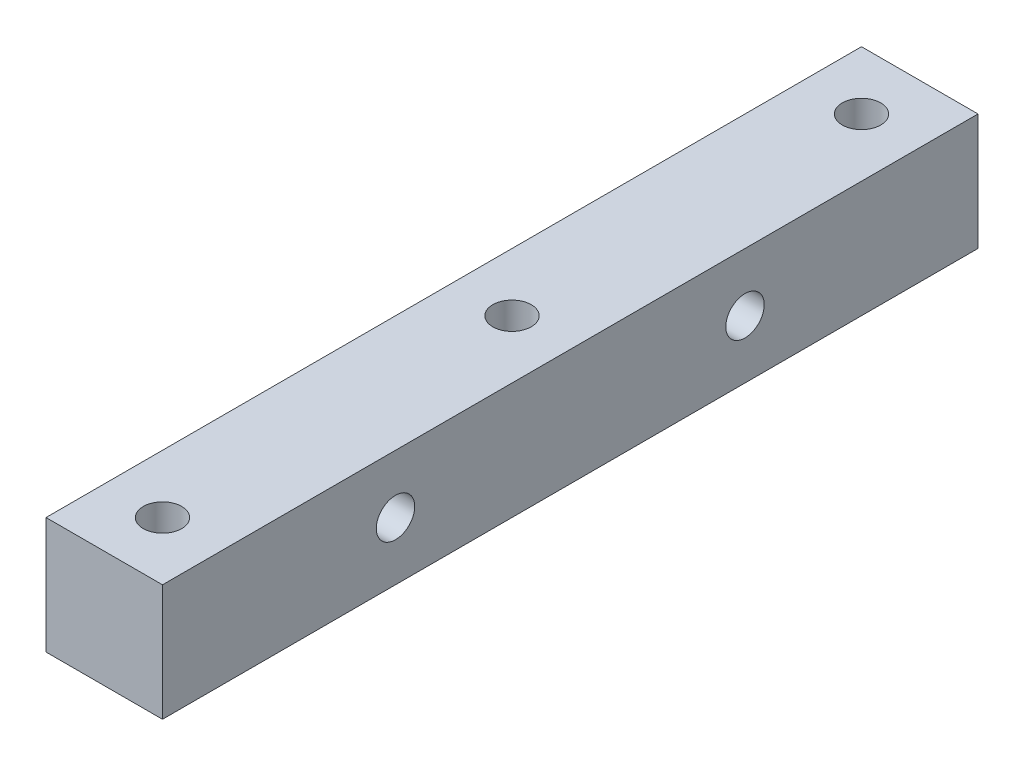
ISO-10303-21;
HEADER;
FILE_DESCRIPTION(('STEP AP214'),'2;1');
FILE_NAME('part.step','',(''),(''),'','','');
FILE_SCHEMA(('AUTOMOTIVE_DESIGN { 1 0 10303 214 1 1 1 1 }'));
ENDSEC;
DATA;
#1=APPLICATION_CONTEXT('core data for automotive mechanical design processes');
#2=APPLICATION_PROTOCOL_DEFINITION('international standard','automotive_design',2000,#1);
#3=PRODUCT_CONTEXT('',#1,'mechanical');
#4=PRODUCT('Part','Part','',(#3));
#5=PRODUCT_RELATED_PRODUCT_CATEGORY('part','',(#4));
#6=PRODUCT_DEFINITION_FORMATION('','',#4);
#7=PRODUCT_DEFINITION_CONTEXT('part definition',#1,'design');
#8=PRODUCT_DEFINITION('design','',#6,#7);
#9=PRODUCT_DEFINITION_SHAPE('','',#8);
#10=(LENGTH_UNIT() NAMED_UNIT(*) SI_UNIT(.MILLI.,.METRE.));
#11=(NAMED_UNIT(*) PLANE_ANGLE_UNIT() SI_UNIT($,.RADIAN.));
#12=(NAMED_UNIT(*) SI_UNIT($,.STERADIAN.) SOLID_ANGLE_UNIT());
#13=UNCERTAINTY_MEASURE_WITH_UNIT(LENGTH_MEASURE(1.E-05),#10,'distance_accuracy_value','');
#14=(GEOMETRIC_REPRESENTATION_CONTEXT(3) GLOBAL_UNCERTAINTY_ASSIGNED_CONTEXT((#13)) GLOBAL_UNIT_ASSIGNED_CONTEXT((#10,
#11,#12)) REPRESENTATION_CONTEXT('',''));
#15=CARTESIAN_POINT('',(0.,0.,0.));
#16=DIRECTION('',(0.,0.,1.));
#17=DIRECTION('',(1.,0.,0.));
#18=AXIS2_PLACEMENT_3D('',#15,#16,#17);
#19=CARTESIAN_POINT('',(5.,5.,70.));
#20=DIRECTION('',(-1.,0.,0.));
#21=DIRECTION('',(0.,0.,1.));
#22=AXIS2_PLACEMENT_3D('',#19,#20,#21);
#23=PLANE('',#22);
#24=CARTESIAN_POINT('',(5.,0.,50.));
#25=DIRECTION('',(1.,0.,0.));
#26=DIRECTION('',(0.,0.,-1.));
#27=AXIS2_PLACEMENT_3D('',#24,#25,#26);
#28=CIRCLE('',#27,1.64999999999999);
#29=CARTESIAN_POINT('',(5.,0.,48.35));
#30=VERTEX_POINT('',#29);
#31=EDGE_CURVE('E144',#30,#30,#28,.T.);
#32=ORIENTED_EDGE('',*,*,#31,.F.);
#33=EDGE_LOOP('',(#32));
#34=FACE_BOUND('',#33,.T.);
#35=CARTESIAN_POINT('',(5.,0.,20.));
#36=DIRECTION('',(1.,0.,0.));
#37=DIRECTION('',(0.,0.,-1.));
#38=AXIS2_PLACEMENT_3D('',#35,#36,#37);
#39=CIRCLE('',#38,1.64999999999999);
#40=CARTESIAN_POINT('',(5.,0.,18.35));
#41=VERTEX_POINT('',#40);
#42=EDGE_CURVE('E138',#41,#41,#39,.T.);
#43=ORIENTED_EDGE('',*,*,#42,.F.);
#44=EDGE_LOOP('',(#43));
#45=FACE_BOUND('',#44,.T.);
#46=DIRECTION('',(0.,1.,0.));
#47=VECTOR('',#46,1.);
#48=CARTESIAN_POINT('',(5.,5.,0.));
#49=LINE('',#48,#47);
#50=CARTESIAN_POINT('',(5.,-5.,0.));
#51=VERTEX_POINT('',#50);
#52=CARTESIAN_POINT('',(5.,5.,0.));
#53=VERTEX_POINT('',#52);
#54=EDGE_CURVE('E104',#51,#53,#49,.T.);
#55=ORIENTED_EDGE('',*,*,#54,.T.);
#56=DIRECTION('',(0.,0.,-1.));
#57=VECTOR('',#56,1.);
#58=CARTESIAN_POINT('',(5.,5.,70.));
#59=LINE('',#58,#57);
#60=CARTESIAN_POINT('',(5.,5.,70.));
#61=VERTEX_POINT('',#60);
#62=EDGE_CURVE('E11',#61,#53,#59,.T.);
#63=ORIENTED_EDGE('',*,*,#62,.F.);
#64=DIRECTION('',(0.,1.,0.));
#65=VECTOR('',#64,1.);
#66=CARTESIAN_POINT('',(5.,5.,70.));
#67=LINE('',#66,#65);
#68=CARTESIAN_POINT('',(5.,-5.,70.));
#69=VERTEX_POINT('',#68);
#70=EDGE_CURVE('E92',#69,#61,#67,.T.);
#71=ORIENTED_EDGE('',*,*,#70,.F.);
#72=DIRECTION('',(0.,0.,-1.));
#73=VECTOR('',#72,1.);
#74=CARTESIAN_POINT('',(5.,-5.,70.));
#75=LINE('',#74,#73);
#76=EDGE_CURVE('E100',#69,#51,#75,.T.);
#77=ORIENTED_EDGE('',*,*,#76,.T.);
#78=EDGE_LOOP('',(#55,#63,#71,#77));
#79=FACE_BOUND('',#78,.T.);
#80=ADVANCED_FACE('F41',(#34,#45,#79),#23,.F.);
#81=CARTESIAN_POINT('',(-5.,5.,70.));
#82=DIRECTION('',(0.,-1.,0.));
#83=DIRECTION('',(0.,0.,-1.));
#84=AXIS2_PLACEMENT_3D('',#81,#82,#83);
#85=PLANE('',#84);
#86=CARTESIAN_POINT('',(0.,5.,5.));
#87=DIRECTION('',(0.,1.,0.));
#88=DIRECTION('',(0.,0.,1.));
#89=AXIS2_PLACEMENT_3D('',#86,#87,#88);
#90=CIRCLE('',#89,1.64999999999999);
#91=CARTESIAN_POINT('',(0.,5.,6.64999999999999));
#92=VERTEX_POINT('',#91);
#93=EDGE_CURVE('E132',#92,#92,#90,.T.);
#94=ORIENTED_EDGE('',*,*,#93,.F.);
#95=EDGE_LOOP('',(#94));
#96=FACE_BOUND('',#95,.T.);
#97=CARTESIAN_POINT('',(0.,5.,35.));
#98=DIRECTION('',(0.,1.,0.));
#99=DIRECTION('',(0.,0.,1.));
#100=AXIS2_PLACEMENT_3D('',#97,#98,#99);
#101=CIRCLE('',#100,1.64999999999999);
#102=CARTESIAN_POINT('',(0.,5.,36.65));
#103=VERTEX_POINT('',#102);
#104=EDGE_CURVE('E126',#103,#103,#101,.T.);
#105=ORIENTED_EDGE('',*,*,#104,.F.);
#106=EDGE_LOOP('',(#105));
#107=FACE_BOUND('',#106,.T.);
#108=CARTESIAN_POINT('',(0.,5.,65.));
#109=DIRECTION('',(0.,1.,0.));
#110=DIRECTION('',(0.,0.,1.));
#111=AXIS2_PLACEMENT_3D('',#108,#109,#110);
#112=CIRCLE('',#111,1.64999999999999);
#113=CARTESIAN_POINT('',(0.,5.,66.65));
#114=VERTEX_POINT('',#113);
#115=EDGE_CURVE('E120',#114,#114,#112,.T.);
#116=ORIENTED_EDGE('',*,*,#115,.F.);
#117=EDGE_LOOP('',(#116));
#118=FACE_BOUND('',#117,.T.);
#119=DIRECTION('',(-1.,0.,0.));
#120=VECTOR('',#119,1.);
#121=CARTESIAN_POINT('',(-5.,5.,0.));
#122=LINE('',#121,#120);
#123=CARTESIAN_POINT('',(-5.,5.,0.));
#124=VERTEX_POINT('',#123);
#125=EDGE_CURVE('E96',#53,#124,#122,.T.);
#126=ORIENTED_EDGE('',*,*,#125,.T.);
#127=DIRECTION('',(0.,0.,-1.));
#128=VECTOR('',#127,1.);
#129=CARTESIAN_POINT('',(-5.,5.,70.));
#130=LINE('',#129,#128);
#131=CARTESIAN_POINT('',(-5.,5.,70.));
#132=VERTEX_POINT('',#131);
#133=EDGE_CURVE('E49',#132,#124,#130,.T.);
#134=ORIENTED_EDGE('',*,*,#133,.F.);
#135=DIRECTION('',(-1.,0.,0.));
#136=VECTOR('',#135,1.);
#137=CARTESIAN_POINT('',(-5.,5.,70.));
#138=LINE('',#137,#136);
#139=EDGE_CURVE('E87',#61,#132,#138,.T.);
#140=ORIENTED_EDGE('',*,*,#139,.F.);
#141=ORIENTED_EDGE('',*,*,#62,.T.);
#142=EDGE_LOOP('',(#126,#134,#140,#141));
#143=FACE_BOUND('',#142,.T.);
#144=ADVANCED_FACE('F95',(#96,#107,#118,#143),#85,.F.);
#145=CARTESIAN_POINT('',(-5.,5.,70.));
#146=DIRECTION('',(1.,0.,0.));
#147=DIRECTION('',(0.,1.,0.));
#148=AXIS2_PLACEMENT_3D('',#145,#146,#147);
#149=PLANE('',#148);
#150=CARTESIAN_POINT('',(-5.,0.,50.));
#151=DIRECTION('',(1.,0.,0.));
#152=DIRECTION('',(0.,0.,-1.));
#153=AXIS2_PLACEMENT_3D('',#150,#151,#152);
#154=CIRCLE('',#153,1.64999999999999);
#155=CARTESIAN_POINT('',(-5.,0.,48.35));
#156=VERTEX_POINT('',#155);
#157=EDGE_CURVE('E141',#156,#156,#154,.T.);
#158=ORIENTED_EDGE('',*,*,#157,.T.);
#159=EDGE_LOOP('',(#158));
#160=FACE_BOUND('',#159,.T.);
#161=CARTESIAN_POINT('',(-5.,0.,20.));
#162=DIRECTION('',(1.,0.,0.));
#163=DIRECTION('',(0.,0.,-1.));
#164=AXIS2_PLACEMENT_3D('',#161,#162,#163);
#165=CIRCLE('',#164,1.64999999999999);
#166=CARTESIAN_POINT('',(-5.,0.,18.35));
#167=VERTEX_POINT('',#166);
#168=EDGE_CURVE('E135',#167,#167,#165,.T.);
#169=ORIENTED_EDGE('',*,*,#168,.T.);
#170=EDGE_LOOP('',(#169));
#171=FACE_BOUND('',#170,.T.);
#172=DIRECTION('',(0.,-1.,0.));
#173=VECTOR('',#172,1.);
#174=CARTESIAN_POINT('',(-5.,5.,0.));
#175=LINE('',#174,#173);
#176=CARTESIAN_POINT('',(-5.,-5.,0.));
#177=VERTEX_POINT('',#176);
#178=EDGE_CURVE('E74',#124,#177,#175,.T.);
#179=ORIENTED_EDGE('',*,*,#178,.T.);
#180=DIRECTION('',(0.,0.,-1.));
#181=VECTOR('',#180,1.);
#182=CARTESIAN_POINT('',(-5.,-5.,70.));
#183=LINE('',#182,#181);
#184=CARTESIAN_POINT('',(-5.,-5.,70.));
#185=VERTEX_POINT('',#184);
#186=EDGE_CURVE('E97',#185,#177,#183,.T.);
#187=ORIENTED_EDGE('',*,*,#186,.F.);
#188=DIRECTION('',(0.,-1.,0.));
#189=VECTOR('',#188,1.);
#190=CARTESIAN_POINT('',(-5.,5.,70.));
#191=LINE('',#190,#189);
#192=EDGE_CURVE('E90',#132,#185,#191,.T.);
#193=ORIENTED_EDGE('',*,*,#192,.F.);
#194=ORIENTED_EDGE('',*,*,#133,.T.);
#195=EDGE_LOOP('',(#179,#187,#193,#194));
#196=FACE_BOUND('',#195,.T.);
#197=ADVANCED_FACE('F98',(#160,#171,#196),#149,.F.);
#198=CARTESIAN_POINT('',(-5.,-5.,70.));
#199=DIRECTION('',(0.,1.,0.));
#200=DIRECTION('',(0.,0.,1.));
#201=AXIS2_PLACEMENT_3D('',#198,#199,#200);
#202=PLANE('',#201);
#203=CARTESIAN_POINT('',(0.,-5.,5.));
#204=DIRECTION('',(0.,1.,0.));
#205=DIRECTION('',(0.,0.,1.));
#206=AXIS2_PLACEMENT_3D('',#203,#204,#205);
#207=CIRCLE('',#206,1.64999999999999);
#208=CARTESIAN_POINT('',(0.,-5.,6.64999999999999));
#209=VERTEX_POINT('',#208);
#210=EDGE_CURVE('E129',#209,#209,#207,.T.);
#211=ORIENTED_EDGE('',*,*,#210,.T.);
#212=EDGE_LOOP('',(#211));
#213=FACE_BOUND('',#212,.T.);
#214=CARTESIAN_POINT('',(0.,-5.,35.));
#215=DIRECTION('',(0.,1.,0.));
#216=DIRECTION('',(0.,0.,1.));
#217=AXIS2_PLACEMENT_3D('',#214,#215,#216);
#218=CIRCLE('',#217,1.64999999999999);
#219=CARTESIAN_POINT('',(0.,-5.,36.65));
#220=VERTEX_POINT('',#219);
#221=EDGE_CURVE('E123',#220,#220,#218,.T.);
#222=ORIENTED_EDGE('',*,*,#221,.T.);
#223=EDGE_LOOP('',(#222));
#224=FACE_BOUND('',#223,.T.);
#225=CARTESIAN_POINT('',(0.,-5.,65.));
#226=DIRECTION('',(0.,1.,0.));
#227=DIRECTION('',(0.,0.,1.));
#228=AXIS2_PLACEMENT_3D('',#225,#226,#227);
#229=CIRCLE('',#228,1.64999999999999);
#230=CARTESIAN_POINT('',(0.,-5.,66.65));
#231=VERTEX_POINT('',#230);
#232=EDGE_CURVE('E107',#231,#231,#229,.T.);
#233=ORIENTED_EDGE('',*,*,#232,.T.);
#234=EDGE_LOOP('',(#233));
#235=FACE_BOUND('',#234,.T.);
#236=DIRECTION('',(1.,0.,0.));
#237=VECTOR('',#236,1.);
#238=CARTESIAN_POINT('',(-5.,-5.,0.));
#239=LINE('',#238,#237);
#240=EDGE_CURVE('E80',#177,#51,#239,.T.);
#241=ORIENTED_EDGE('',*,*,#240,.T.);
#242=ORIENTED_EDGE('',*,*,#76,.F.);
#243=DIRECTION('',(1.,0.,0.));
#244=VECTOR('',#243,1.);
#245=CARTESIAN_POINT('',(-5.,-5.,70.));
#246=LINE('',#245,#244);
#247=EDGE_CURVE('E57',#185,#69,#246,.T.);
#248=ORIENTED_EDGE('',*,*,#247,.F.);
#249=ORIENTED_EDGE('',*,*,#186,.T.);
#250=EDGE_LOOP('',(#241,#242,#248,#249));
#251=FACE_BOUND('',#250,.T.);
#252=ADVANCED_FACE('F112',(#213,#224,#235,#251),#202,.F.);
#253=CARTESIAN_POINT('',(0.,0.,70.));
#254=DIRECTION('',(0.,0.,1.));
#255=DIRECTION('',(1.,0.,0.));
#256=AXIS2_PLACEMENT_3D('',#253,#254,#255);
#257=PLANE('',#256);
#258=ORIENTED_EDGE('',*,*,#70,.T.);
#259=ORIENTED_EDGE('',*,*,#139,.T.);
#260=ORIENTED_EDGE('',*,*,#192,.T.);
#261=ORIENTED_EDGE('',*,*,#247,.T.);
#262=EDGE_LOOP('',(#258,#259,#260,#261));
#263=FACE_BOUND('',#262,.T.);
#264=ADVANCED_FACE('F88',(#263),#257,.T.);
#265=CARTESIAN_POINT('',(0.,0.,0.));
#266=DIRECTION('',(0.,0.,1.));
#267=DIRECTION('',(1.,0.,0.));
#268=AXIS2_PLACEMENT_3D('',#265,#266,#267);
#269=PLANE('',#268);
#270=ORIENTED_EDGE('',*,*,#54,.F.);
#271=ORIENTED_EDGE('',*,*,#240,.F.);
#272=ORIENTED_EDGE('',*,*,#178,.F.);
#273=ORIENTED_EDGE('',*,*,#125,.F.);
#274=EDGE_LOOP('',(#270,#271,#272,#273));
#275=FACE_BOUND('',#274,.T.);
#276=ADVANCED_FACE('F115',(#275),#269,.F.);
#277=CARTESIAN_POINT('',(0.,5.,65.));
#278=DIRECTION('',(0.,1.,0.));
#279=DIRECTION('',(0.,0.,1.));
#280=AXIS2_PLACEMENT_3D('',#277,#278,#279);
#281=CYLINDRICAL_SURFACE('',#280,1.64999999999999);
#282=ORIENTED_EDGE('',*,*,#232,.F.);
#283=EDGE_LOOP('',(#282));
#284=FACE_BOUND('',#283,.T.);
#285=ORIENTED_EDGE('',*,*,#115,.T.);
#286=EDGE_LOOP('',(#285));
#287=FACE_BOUND('',#286,.T.);
#288=ADVANCED_FACE('F172',(#284,#287),#281,.F.);
#289=CARTESIAN_POINT('',(0.,5.,35.));
#290=DIRECTION('',(0.,1.,0.));
#291=DIRECTION('',(0.,0.,1.));
#292=AXIS2_PLACEMENT_3D('',#289,#290,#291);
#293=CYLINDRICAL_SURFACE('',#292,1.64999999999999);
#294=ORIENTED_EDGE('',*,*,#221,.F.);
#295=EDGE_LOOP('',(#294));
#296=FACE_BOUND('',#295,.T.);
#297=ORIENTED_EDGE('',*,*,#104,.T.);
#298=EDGE_LOOP('',(#297));
#299=FACE_BOUND('',#298,.T.);
#300=ADVANCED_FACE('F165',(#296,#299),#293,.F.);
#301=CARTESIAN_POINT('',(0.,5.,5.));
#302=DIRECTION('',(0.,1.,0.));
#303=DIRECTION('',(0.,0.,1.));
#304=AXIS2_PLACEMENT_3D('',#301,#302,#303);
#305=CYLINDRICAL_SURFACE('',#304,1.64999999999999);
#306=ORIENTED_EDGE('',*,*,#210,.F.);
#307=EDGE_LOOP('',(#306));
#308=FACE_BOUND('',#307,.T.);
#309=ORIENTED_EDGE('',*,*,#93,.T.);
#310=EDGE_LOOP('',(#309));
#311=FACE_BOUND('',#310,.T.);
#312=ADVANCED_FACE('F156',(#308,#311),#305,.F.);
#313=CARTESIAN_POINT('',(5.,0.,20.));
#314=DIRECTION('',(1.,0.,0.));
#315=DIRECTION('',(0.,0.,-1.));
#316=AXIS2_PLACEMENT_3D('',#313,#314,#315);
#317=CYLINDRICAL_SURFACE('',#316,1.64999999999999);
#318=ORIENTED_EDGE('',*,*,#168,.F.);
#319=EDGE_LOOP('',(#318));
#320=FACE_BOUND('',#319,.T.);
#321=ORIENTED_EDGE('',*,*,#42,.T.);
#322=EDGE_LOOP('',(#321));
#323=FACE_BOUND('',#322,.T.);
#324=ADVANCED_FACE('F154',(#320,#323),#317,.F.);
#325=CARTESIAN_POINT('',(5.,0.,50.));
#326=DIRECTION('',(1.,0.,0.));
#327=DIRECTION('',(0.,0.,-1.));
#328=AXIS2_PLACEMENT_3D('',#325,#326,#327);
#329=CYLINDRICAL_SURFACE('',#328,1.64999999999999);
#330=ORIENTED_EDGE('',*,*,#157,.F.);
#331=EDGE_LOOP('',(#330));
#332=FACE_BOUND('',#331,.T.);
#333=ORIENTED_EDGE('',*,*,#31,.T.);
#334=EDGE_LOOP('',(#333));
#335=FACE_BOUND('',#334,.T.);
#336=ADVANCED_FACE('F148',(#332,#335),#329,.F.);
#337=CLOSED_SHELL('',(#80,#144,#197,#252,#264,#276,#288,#300,#312,#324,#336));
#338=MANIFOLD_SOLID_BREP('B2',#337);
#339=ADVANCED_BREP_SHAPE_REPRESENTATION('',(#18,#338),#14);
#340=SHAPE_DEFINITION_REPRESENTATION(#9,#339);
ENDSEC;
END-ISO-10303-21;
